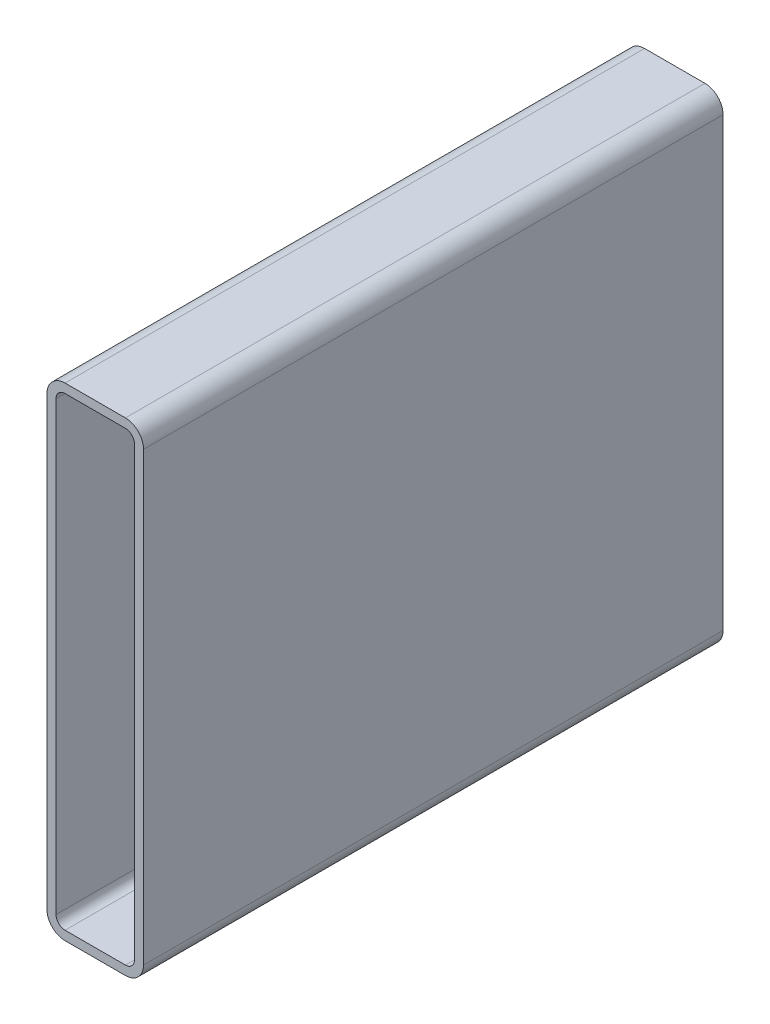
ISO-10303-21;
HEADER;
FILE_DESCRIPTION(('STEP AP214'),'2;1');
FILE_NAME('part.step','',(''),(''),'','','');
FILE_SCHEMA(('AUTOMOTIVE_DESIGN { 1 0 10303 214 1 1 1 1 }'));
ENDSEC;
DATA;
#1=APPLICATION_CONTEXT('core data for automotive mechanical design processes');
#2=APPLICATION_PROTOCOL_DEFINITION('international standard','automotive_design',2000,#1);
#3=PRODUCT_CONTEXT('',#1,'mechanical');
#4=PRODUCT('Part','Part','',(#3));
#5=PRODUCT_RELATED_PRODUCT_CATEGORY('part','',(#4));
#6=PRODUCT_DEFINITION_FORMATION('','',#4);
#7=PRODUCT_DEFINITION_CONTEXT('part definition',#1,'design');
#8=PRODUCT_DEFINITION('design','',#6,#7);
#9=PRODUCT_DEFINITION_SHAPE('','',#8);
#10=(LENGTH_UNIT() NAMED_UNIT(*) SI_UNIT(.MILLI.,.METRE.));
#11=(NAMED_UNIT(*) PLANE_ANGLE_UNIT() SI_UNIT($,.RADIAN.));
#12=(NAMED_UNIT(*) SI_UNIT($,.STERADIAN.) SOLID_ANGLE_UNIT());
#13=UNCERTAINTY_MEASURE_WITH_UNIT(LENGTH_MEASURE(1.E-05),#10,'distance_accuracy_value','');
#14=(GEOMETRIC_REPRESENTATION_CONTEXT(3) GLOBAL_UNCERTAINTY_ASSIGNED_CONTEXT((#13)) GLOBAL_UNIT_ASSIGNED_CONTEXT((#10,
#11,#12)) REPRESENTATION_CONTEXT('',''));
#15=CARTESIAN_POINT('',(0.,0.,0.));
#16=DIRECTION('',(0.,0.,1.));
#17=DIRECTION('',(1.,0.,0.));
#18=AXIS2_PLACEMENT_3D('',#15,#16,#17);
#19=CARTESIAN_POINT('',(9.52500000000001,244.475,304.8));
#20=DIRECTION('',(0.,0.,1.));
#21=DIRECTION('',(1.,0.,0.));
#22=AXIS2_PLACEMENT_3D('',#19,#20,#21);
#23=PLANE('',#22);
#24=CARTESIAN_POINT('',(9.52500000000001,244.475,304.8));
#25=DIRECTION('',(0.,0.,1.));
#26=DIRECTION('',(1.,0.,0.));
#27=AXIS2_PLACEMENT_3D('',#24,#25,#26);
#28=CIRCLE('',#27,9.52500000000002);
#29=CARTESIAN_POINT('',(9.525,254.,304.8));
#30=VERTEX_POINT('',#29);
#31=CARTESIAN_POINT('',(0.,244.475,304.8));
#32=VERTEX_POINT('',#31);
#33=EDGE_CURVE('E211',#30,#32,#28,.T.);
#34=ORIENTED_EDGE('',*,*,#33,.T.);
#35=DIRECTION('',(0.,-1.,0.));
#36=VECTOR('',#35,1.);
#37=CARTESIAN_POINT('',(0.,9.525,304.8));
#38=LINE('',#37,#36);
#39=CARTESIAN_POINT('',(0.,9.525,304.8));
#40=VERTEX_POINT('',#39);
#41=EDGE_CURVE('E214',#32,#40,#38,.T.);
#42=ORIENTED_EDGE('',*,*,#41,.T.);
#43=CARTESIAN_POINT('',(9.525,9.525,304.8));
#44=DIRECTION('',(0.,0.,1.));
#45=DIRECTION('',(1.,0.,0.));
#46=AXIS2_PLACEMENT_3D('',#43,#44,#45);
#47=CIRCLE('',#46,9.525);
#48=CARTESIAN_POINT('',(9.525,0.,304.8));
#49=VERTEX_POINT('',#48);
#50=EDGE_CURVE('E217',#40,#49,#47,.T.);
#51=ORIENTED_EDGE('',*,*,#50,.T.);
#52=DIRECTION('',(1.,0.,0.));
#53=VECTOR('',#52,1.);
#54=CARTESIAN_POINT('',(41.275,0.,304.8));
#55=LINE('',#54,#53);
#56=CARTESIAN_POINT('',(41.275,0.,304.8));
#57=VERTEX_POINT('',#56);
#58=EDGE_CURVE('E219',#49,#57,#55,.T.);
#59=ORIENTED_EDGE('',*,*,#58,.T.);
#60=CARTESIAN_POINT('',(41.275,9.525,304.8));
#61=DIRECTION('',(0.,0.,1.));
#62=DIRECTION('',(1.,0.,0.));
#63=AXIS2_PLACEMENT_3D('',#60,#61,#62);
#64=CIRCLE('',#63,9.525);
#65=CARTESIAN_POINT('',(50.8,9.525,304.8));
#66=VERTEX_POINT('',#65);
#67=EDGE_CURVE('E221',#57,#66,#64,.T.);
#68=ORIENTED_EDGE('',*,*,#67,.T.);
#69=DIRECTION('',(0.,1.,0.));
#70=VECTOR('',#69,1.);
#71=CARTESIAN_POINT('',(50.8,244.475,304.8));
#72=LINE('',#71,#70);
#73=CARTESIAN_POINT('',(50.8,244.475,304.8));
#74=VERTEX_POINT('',#73);
#75=EDGE_CURVE('E223',#66,#74,#72,.T.);
#76=ORIENTED_EDGE('',*,*,#75,.T.);
#77=CARTESIAN_POINT('',(41.275,244.475,304.8));
#78=DIRECTION('',(0.,0.,1.));
#79=DIRECTION('',(1.,0.,0.));
#80=AXIS2_PLACEMENT_3D('',#77,#78,#79);
#81=CIRCLE('',#80,9.52500000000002);
#82=CARTESIAN_POINT('',(41.275,254.,304.8));
#83=VERTEX_POINT('',#82);
#84=EDGE_CURVE('E225',#74,#83,#81,.T.);
#85=ORIENTED_EDGE('',*,*,#84,.T.);
#86=DIRECTION('',(-1.,0.,0.));
#87=VECTOR('',#86,1.);
#88=CARTESIAN_POINT('',(9.525,254.,304.8));
#89=LINE('',#88,#87);
#90=EDGE_CURVE('E227',#83,#30,#89,.T.);
#91=ORIENTED_EDGE('',*,*,#90,.T.);
#92=EDGE_LOOP('',(#34,#42,#51,#59,#68,#76,#85,#91));
#93=FACE_BOUND('',#92,.T.);
#94=DIRECTION('',(0.,-1.,0.));
#95=VECTOR('',#94,1.);
#96=CARTESIAN_POINT('',(4.7625,9.525,304.8));
#97=LINE('',#96,#95);
#98=CARTESIAN_POINT('',(4.7625,244.475,304.8));
#99=VERTEX_POINT('',#98);
#100=CARTESIAN_POINT('',(4.7625,9.525,304.8));
#101=VERTEX_POINT('',#100);
#102=EDGE_CURVE('E154',#99,#101,#97,.T.);
#103=ORIENTED_EDGE('',*,*,#102,.F.);
#104=CARTESIAN_POINT('',(9.52500000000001,244.475,304.8));
#105=DIRECTION('',(0.,0.,1.));
#106=DIRECTION('',(1.,0.,0.));
#107=AXIS2_PLACEMENT_3D('',#104,#105,#106);
#108=CIRCLE('',#107,4.76250000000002);
#109=CARTESIAN_POINT('',(9.525,249.2375,304.8));
#110=VERTEX_POINT('',#109);
#111=EDGE_CURVE('E146',#110,#99,#108,.T.);
#112=ORIENTED_EDGE('',*,*,#111,.F.);
#113=DIRECTION('',(-1.,0.,0.));
#114=VECTOR('',#113,1.);
#115=CARTESIAN_POINT('',(9.525,249.2375,304.8));
#116=LINE('',#115,#114);
#117=CARTESIAN_POINT('',(41.275,249.2375,304.8));
#118=VERTEX_POINT('',#117);
#119=EDGE_CURVE('E179',#118,#110,#116,.T.);
#120=ORIENTED_EDGE('',*,*,#119,.F.);
#121=CARTESIAN_POINT('',(41.275,244.475,304.8));
#122=DIRECTION('',(0.,0.,1.));
#123=DIRECTION('',(1.,0.,0.));
#124=AXIS2_PLACEMENT_3D('',#121,#122,#123);
#125=CIRCLE('',#124,4.76250000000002);
#126=CARTESIAN_POINT('',(46.0375,244.475,304.8));
#127=VERTEX_POINT('',#126);
#128=EDGE_CURVE('E177',#127,#118,#125,.T.);
#129=ORIENTED_EDGE('',*,*,#128,.F.);
#130=DIRECTION('',(0.,1.,0.));
#131=VECTOR('',#130,1.);
#132=CARTESIAN_POINT('',(46.0375,244.475,304.8));
#133=LINE('',#132,#131);
#134=CARTESIAN_POINT('',(46.0375,9.525,304.8));
#135=VERTEX_POINT('',#134);
#136=EDGE_CURVE('E175',#135,#127,#133,.T.);
#137=ORIENTED_EDGE('',*,*,#136,.F.);
#138=CARTESIAN_POINT('',(41.275,9.525,304.8));
#139=DIRECTION('',(0.,0.,1.));
#140=DIRECTION('',(1.,0.,0.));
#141=AXIS2_PLACEMENT_3D('',#138,#139,#140);
#142=CIRCLE('',#141,4.7625);
#143=CARTESIAN_POINT('',(41.275,4.7625,304.8));
#144=VERTEX_POINT('',#143);
#145=EDGE_CURVE('E173',#144,#135,#142,.T.);
#146=ORIENTED_EDGE('',*,*,#145,.F.);
#147=DIRECTION('',(1.,0.,0.));
#148=VECTOR('',#147,1.);
#149=CARTESIAN_POINT('',(41.275,4.7625,304.8));
#150=LINE('',#149,#148);
#151=CARTESIAN_POINT('',(9.525,4.7625,304.8));
#152=VERTEX_POINT('',#151);
#153=EDGE_CURVE('E169',#152,#144,#150,.T.);
#154=ORIENTED_EDGE('',*,*,#153,.F.);
#155=CARTESIAN_POINT('',(9.525,9.525,304.8));
#156=DIRECTION('',(0.,0.,1.));
#157=DIRECTION('',(1.,0.,0.));
#158=AXIS2_PLACEMENT_3D('',#155,#156,#157);
#159=CIRCLE('',#158,4.7625);
#160=EDGE_CURVE('E167',#101,#152,#159,.T.);
#161=ORIENTED_EDGE('',*,*,#160,.F.);
#162=EDGE_LOOP('',(#103,#112,#120,#129,#137,#146,#154,#161));
#163=FACE_BOUND('',#162,.T.);
#164=ADVANCED_FACE('F33',(#93,#163),#23,.T.);
#165=CARTESIAN_POINT('',(9.52500000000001,244.475,0.));
#166=DIRECTION('',(0.,0.,1.));
#167=DIRECTION('',(1.,0.,0.));
#168=AXIS2_PLACEMENT_3D('',#165,#166,#167);
#169=PLANE('',#168);
#170=CARTESIAN_POINT('',(9.52500000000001,244.475,0.));
#171=DIRECTION('',(0.,0.,1.));
#172=DIRECTION('',(1.,0.,0.));
#173=AXIS2_PLACEMENT_3D('',#170,#171,#172);
#174=CIRCLE('',#173,9.52500000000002);
#175=CARTESIAN_POINT('',(9.525,254.,0.));
#176=VERTEX_POINT('',#175);
#177=CARTESIAN_POINT('',(0.,244.475,0.));
#178=VERTEX_POINT('',#177);
#179=EDGE_CURVE('E162',#176,#178,#174,.T.);
#180=ORIENTED_EDGE('',*,*,#179,.F.);
#181=DIRECTION('',(-1.,0.,0.));
#182=VECTOR('',#181,1.);
#183=CARTESIAN_POINT('',(9.525,254.,0.));
#184=LINE('',#183,#182);
#185=CARTESIAN_POINT('',(41.275,254.,0.));
#186=VERTEX_POINT('',#185);
#187=EDGE_CURVE('E215',#186,#176,#184,.T.);
#188=ORIENTED_EDGE('',*,*,#187,.F.);
#189=CARTESIAN_POINT('',(41.275,244.475,0.));
#190=DIRECTION('',(0.,0.,1.));
#191=DIRECTION('',(1.,0.,0.));
#192=AXIS2_PLACEMENT_3D('',#189,#190,#191);
#193=CIRCLE('',#192,9.52500000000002);
#194=CARTESIAN_POINT('',(50.8,244.475,0.));
#195=VERTEX_POINT('',#194);
#196=EDGE_CURVE('E242',#195,#186,#193,.T.);
#197=ORIENTED_EDGE('',*,*,#196,.F.);
#198=DIRECTION('',(0.,1.,0.));
#199=VECTOR('',#198,1.);
#200=CARTESIAN_POINT('',(50.8,244.475,0.));
#201=LINE('',#200,#199);
#202=CARTESIAN_POINT('',(50.8,9.525,0.));
#203=VERTEX_POINT('',#202);
#204=EDGE_CURVE('E240',#203,#195,#201,.T.);
#205=ORIENTED_EDGE('',*,*,#204,.F.);
#206=CARTESIAN_POINT('',(41.275,9.525,0.));
#207=DIRECTION('',(0.,0.,1.));
#208=DIRECTION('',(1.,0.,0.));
#209=AXIS2_PLACEMENT_3D('',#206,#207,#208);
#210=CIRCLE('',#209,9.525);
#211=CARTESIAN_POINT('',(41.275,0.,0.));
#212=VERTEX_POINT('',#211);
#213=EDGE_CURVE('E238',#212,#203,#210,.T.);
#214=ORIENTED_EDGE('',*,*,#213,.F.);
#215=DIRECTION('',(1.,0.,0.));
#216=VECTOR('',#215,1.);
#217=CARTESIAN_POINT('',(41.275,0.,0.));
#218=LINE('',#217,#216);
#219=CARTESIAN_POINT('',(9.525,0.,0.));
#220=VERTEX_POINT('',#219);
#221=EDGE_CURVE('E236',#220,#212,#218,.T.);
#222=ORIENTED_EDGE('',*,*,#221,.F.);
#223=CARTESIAN_POINT('',(9.525,9.525,0.));
#224=DIRECTION('',(0.,0.,1.));
#225=DIRECTION('',(1.,0.,0.));
#226=AXIS2_PLACEMENT_3D('',#223,#224,#225);
#227=CIRCLE('',#226,9.525);
#228=CARTESIAN_POINT('',(0.,9.525,0.));
#229=VERTEX_POINT('',#228);
#230=EDGE_CURVE('E234',#229,#220,#227,.T.);
#231=ORIENTED_EDGE('',*,*,#230,.F.);
#232=DIRECTION('',(0.,-1.,0.));
#233=VECTOR('',#232,1.);
#234=CARTESIAN_POINT('',(0.,9.525,0.));
#235=LINE('',#234,#233);
#236=EDGE_CURVE('E232',#178,#229,#235,.T.);
#237=ORIENTED_EDGE('',*,*,#236,.F.);
#238=EDGE_LOOP('',(#180,#188,#197,#205,#214,#222,#231,#237));
#239=FACE_BOUND('',#238,.T.);
#240=CARTESIAN_POINT('',(9.52500000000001,244.475,0.));
#241=DIRECTION('',(0.,0.,1.));
#242=DIRECTION('',(1.,0.,0.));
#243=AXIS2_PLACEMENT_3D('',#240,#241,#242);
#244=CIRCLE('',#243,4.76250000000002);
#245=CARTESIAN_POINT('',(9.525,249.2375,0.));
#246=VERTEX_POINT('',#245);
#247=CARTESIAN_POINT('',(4.7625,244.475,0.));
#248=VERTEX_POINT('',#247);
#249=EDGE_CURVE('E56',#246,#248,#244,.T.);
#250=ORIENTED_EDGE('',*,*,#249,.T.);
#251=DIRECTION('',(0.,-1.,0.));
#252=VECTOR('',#251,1.);
#253=CARTESIAN_POINT('',(4.7625,9.525,0.));
#254=LINE('',#253,#252);
#255=CARTESIAN_POINT('',(4.7625,9.525,0.));
#256=VERTEX_POINT('',#255);
#257=EDGE_CURVE('E161',#248,#256,#254,.T.);
#258=ORIENTED_EDGE('',*,*,#257,.T.);
#259=CARTESIAN_POINT('',(9.525,9.525,0.));
#260=DIRECTION('',(0.,0.,1.));
#261=DIRECTION('',(1.,0.,0.));
#262=AXIS2_PLACEMENT_3D('',#259,#260,#261);
#263=CIRCLE('',#262,4.7625);
#264=CARTESIAN_POINT('',(9.525,4.7625,0.));
#265=VERTEX_POINT('',#264);
#266=EDGE_CURVE('E183',#256,#265,#263,.T.);
#267=ORIENTED_EDGE('',*,*,#266,.T.);
#268=DIRECTION('',(1.,0.,0.));
#269=VECTOR('',#268,1.);
#270=CARTESIAN_POINT('',(41.275,4.7625,0.));
#271=LINE('',#270,#269);
#272=CARTESIAN_POINT('',(41.275,4.7625,0.));
#273=VERTEX_POINT('',#272);
#274=EDGE_CURVE('E186',#265,#273,#271,.T.);
#275=ORIENTED_EDGE('',*,*,#274,.T.);
#276=CARTESIAN_POINT('',(41.275,9.525,0.));
#277=DIRECTION('',(0.,0.,1.));
#278=DIRECTION('',(1.,0.,0.));
#279=AXIS2_PLACEMENT_3D('',#276,#277,#278);
#280=CIRCLE('',#279,4.7625);
#281=CARTESIAN_POINT('',(46.0375,9.525,0.));
#282=VERTEX_POINT('',#281);
#283=EDGE_CURVE('E189',#273,#282,#280,.T.);
#284=ORIENTED_EDGE('',*,*,#283,.T.);
#285=DIRECTION('',(0.,1.,0.));
#286=VECTOR('',#285,1.);
#287=CARTESIAN_POINT('',(46.0375,244.475,0.));
#288=LINE('',#287,#286);
#289=CARTESIAN_POINT('',(46.0375,244.475,0.));
#290=VERTEX_POINT('',#289);
#291=EDGE_CURVE('E192',#282,#290,#288,.T.);
#292=ORIENTED_EDGE('',*,*,#291,.T.);
#293=CARTESIAN_POINT('',(41.275,244.475,0.));
#294=DIRECTION('',(0.,0.,1.));
#295=DIRECTION('',(1.,0.,0.));
#296=AXIS2_PLACEMENT_3D('',#293,#294,#295);
#297=CIRCLE('',#296,4.76250000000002);
#298=CARTESIAN_POINT('',(41.275,249.2375,0.));
#299=VERTEX_POINT('',#298);
#300=EDGE_CURVE('E195',#290,#299,#297,.T.);
#301=ORIENTED_EDGE('',*,*,#300,.T.);
#302=DIRECTION('',(-1.,0.,0.));
#303=VECTOR('',#302,1.);
#304=CARTESIAN_POINT('',(9.525,249.2375,0.));
#305=LINE('',#304,#303);
#306=EDGE_CURVE('E155',#299,#246,#305,.T.);
#307=ORIENTED_EDGE('',*,*,#306,.T.);
#308=EDGE_LOOP('',(#250,#258,#267,#275,#284,#292,#301,#307));
#309=FACE_BOUND('',#308,.T.);
#310=ADVANCED_FACE('F272',(#239,#309),#169,.F.);
#311=CARTESIAN_POINT('',(9.52500000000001,244.475,304.8));
#312=DIRECTION('',(0.,0.,-1.));
#313=DIRECTION('',(-1.,0.,0.));
#314=AXIS2_PLACEMENT_3D('',#311,#312,#313);
#315=CYLINDRICAL_SURFACE('',#314,9.52500000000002);
#316=ORIENTED_EDGE('',*,*,#179,.T.);
#317=DIRECTION('',(0.,0.,-1.));
#318=VECTOR('',#317,1.);
#319=CARTESIAN_POINT('',(0.,244.475,304.8));
#320=LINE('',#319,#318);
#321=EDGE_CURVE('E11',#32,#178,#320,.T.);
#322=ORIENTED_EDGE('',*,*,#321,.F.);
#323=ORIENTED_EDGE('',*,*,#33,.F.);
#324=DIRECTION('',(0.,0.,-1.));
#325=VECTOR('',#324,1.);
#326=CARTESIAN_POINT('',(9.525,254.,304.8));
#327=LINE('',#326,#325);
#328=EDGE_CURVE('E229',#30,#176,#327,.T.);
#329=ORIENTED_EDGE('',*,*,#328,.T.);
#330=EDGE_LOOP('',(#316,#322,#323,#329));
#331=FACE_BOUND('',#330,.T.);
#332=ADVANCED_FACE('F35',(#331),#315,.T.);
#333=CARTESIAN_POINT('',(0.,9.525,304.8));
#334=DIRECTION('',(1.,0.,0.));
#335=DIRECTION('',(0.,0.,-1.));
#336=AXIS2_PLACEMENT_3D('',#333,#334,#335);
#337=PLANE('',#336);
#338=ORIENTED_EDGE('',*,*,#236,.T.);
#339=DIRECTION('',(0.,0.,-1.));
#340=VECTOR('',#339,1.);
#341=CARTESIAN_POINT('',(0.,9.525,304.8));
#342=LINE('',#341,#340);
#343=EDGE_CURVE('E41',#40,#229,#342,.T.);
#344=ORIENTED_EDGE('',*,*,#343,.F.);
#345=ORIENTED_EDGE('',*,*,#41,.F.);
#346=ORIENTED_EDGE('',*,*,#321,.T.);
#347=EDGE_LOOP('',(#338,#344,#345,#346));
#348=FACE_BOUND('',#347,.T.);
#349=ADVANCED_FACE('F289',(#348),#337,.F.);
#350=CARTESIAN_POINT('',(9.525,9.525,304.8));
#351=DIRECTION('',(0.,0.,-1.));
#352=DIRECTION('',(-1.,0.,0.));
#353=AXIS2_PLACEMENT_3D('',#350,#351,#352);
#354=CYLINDRICAL_SURFACE('',#353,9.525);
#355=ORIENTED_EDGE('',*,*,#230,.T.);
#356=DIRECTION('',(0.,0.,-1.));
#357=VECTOR('',#356,1.);
#358=CARTESIAN_POINT('',(9.525,0.,304.8));
#359=LINE('',#358,#357);
#360=EDGE_CURVE('E259',#49,#220,#359,.T.);
#361=ORIENTED_EDGE('',*,*,#360,.F.);
#362=ORIENTED_EDGE('',*,*,#50,.F.);
#363=ORIENTED_EDGE('',*,*,#343,.T.);
#364=EDGE_LOOP('',(#355,#361,#362,#363));
#365=FACE_BOUND('',#364,.T.);
#366=ADVANCED_FACE('F266',(#365),#354,.T.);
#367=CARTESIAN_POINT('',(41.275,0.,304.8));
#368=DIRECTION('',(0.,1.,0.));
#369=DIRECTION('',(0.,0.,1.));
#370=AXIS2_PLACEMENT_3D('',#367,#368,#369);
#371=PLANE('',#370);
#372=ORIENTED_EDGE('',*,*,#221,.T.);
#373=DIRECTION('',(0.,0.,-1.));
#374=VECTOR('',#373,1.);
#375=CARTESIAN_POINT('',(41.275,0.,304.8));
#376=LINE('',#375,#374);
#377=EDGE_CURVE('E256',#57,#212,#376,.T.);
#378=ORIENTED_EDGE('',*,*,#377,.F.);
#379=ORIENTED_EDGE('',*,*,#58,.F.);
#380=ORIENTED_EDGE('',*,*,#360,.T.);
#381=EDGE_LOOP('',(#372,#378,#379,#380));
#382=FACE_BOUND('',#381,.T.);
#383=ADVANCED_FACE('F278',(#382),#371,.F.);
#384=CARTESIAN_POINT('',(41.275,9.525,304.8));
#385=DIRECTION('',(0.,0.,-1.));
#386=DIRECTION('',(-1.,0.,0.));
#387=AXIS2_PLACEMENT_3D('',#384,#385,#386);
#388=CYLINDRICAL_SURFACE('',#387,9.525);
#389=ORIENTED_EDGE('',*,*,#213,.T.);
#390=DIRECTION('',(0.,0.,-1.));
#391=VECTOR('',#390,1.);
#392=CARTESIAN_POINT('',(50.8,9.525,304.8));
#393=LINE('',#392,#391);
#394=EDGE_CURVE('E253',#66,#203,#393,.T.);
#395=ORIENTED_EDGE('',*,*,#394,.F.);
#396=ORIENTED_EDGE('',*,*,#67,.F.);
#397=ORIENTED_EDGE('',*,*,#377,.T.);
#398=EDGE_LOOP('',(#389,#395,#396,#397));
#399=FACE_BOUND('',#398,.T.);
#400=ADVANCED_FACE('F282',(#399),#388,.T.);
#401=CARTESIAN_POINT('',(50.8,244.475,304.8));
#402=DIRECTION('',(-1.,0.,0.));
#403=DIRECTION('',(0.,0.,1.));
#404=AXIS2_PLACEMENT_3D('',#401,#402,#403);
#405=PLANE('',#404);
#406=ORIENTED_EDGE('',*,*,#204,.T.);
#407=DIRECTION('',(0.,0.,-1.));
#408=VECTOR('',#407,1.);
#409=CARTESIAN_POINT('',(50.8,244.475,304.8));
#410=LINE('',#409,#408);
#411=EDGE_CURVE('E250',#74,#195,#410,.T.);
#412=ORIENTED_EDGE('',*,*,#411,.F.);
#413=ORIENTED_EDGE('',*,*,#75,.F.);
#414=ORIENTED_EDGE('',*,*,#394,.T.);
#415=EDGE_LOOP('',(#406,#412,#413,#414));
#416=FACE_BOUND('',#415,.T.);
#417=ADVANCED_FACE('F302',(#416),#405,.F.);
#418=CARTESIAN_POINT('',(41.275,244.475,304.8));
#419=DIRECTION('',(0.,0.,-1.));
#420=DIRECTION('',(-1.,0.,0.));
#421=AXIS2_PLACEMENT_3D('',#418,#419,#420);
#422=CYLINDRICAL_SURFACE('',#421,9.52500000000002);
#423=ORIENTED_EDGE('',*,*,#196,.T.);
#424=DIRECTION('',(0.,0.,-1.));
#425=VECTOR('',#424,1.);
#426=CARTESIAN_POINT('',(41.275,254.,304.8));
#427=LINE('',#426,#425);
#428=EDGE_CURVE('E247',#83,#186,#427,.T.);
#429=ORIENTED_EDGE('',*,*,#428,.F.);
#430=ORIENTED_EDGE('',*,*,#84,.F.);
#431=ORIENTED_EDGE('',*,*,#411,.T.);
#432=EDGE_LOOP('',(#423,#429,#430,#431));
#433=FACE_BOUND('',#432,.T.);
#434=ADVANCED_FACE('F300',(#433),#422,.T.);
#435=CARTESIAN_POINT('',(9.525,254.,304.8));
#436=DIRECTION('',(0.,-1.,0.));
#437=DIRECTION('',(0.,0.,-1.));
#438=AXIS2_PLACEMENT_3D('',#435,#436,#437);
#439=PLANE('',#438);
#440=ORIENTED_EDGE('',*,*,#187,.T.);
#441=ORIENTED_EDGE('',*,*,#328,.F.);
#442=ORIENTED_EDGE('',*,*,#90,.F.);
#443=ORIENTED_EDGE('',*,*,#428,.T.);
#444=EDGE_LOOP('',(#440,#441,#442,#443));
#445=FACE_BOUND('',#444,.T.);
#446=ADVANCED_FACE('F295',(#445),#439,.F.);
#447=CARTESIAN_POINT('',(9.52500000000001,244.475,304.8));
#448=DIRECTION('',(0.,0.,-1.));
#449=DIRECTION('',(-1.,0.,0.));
#450=AXIS2_PLACEMENT_3D('',#447,#448,#449);
#451=CYLINDRICAL_SURFACE('',#450,4.76250000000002);
#452=ORIENTED_EDGE('',*,*,#249,.F.);
#453=DIRECTION('',(0.,0.,-1.));
#454=VECTOR('',#453,1.);
#455=CARTESIAN_POINT('',(9.525,249.2375,304.8));
#456=LINE('',#455,#454);
#457=EDGE_CURVE('E150',#110,#246,#456,.T.);
#458=ORIENTED_EDGE('',*,*,#457,.F.);
#459=ORIENTED_EDGE('',*,*,#111,.T.);
#460=DIRECTION('',(0.,0.,-1.));
#461=VECTOR('',#460,1.);
#462=CARTESIAN_POINT('',(4.7625,244.475,304.8));
#463=LINE('',#462,#461);
#464=EDGE_CURVE('E149',#99,#248,#463,.T.);
#465=ORIENTED_EDGE('',*,*,#464,.T.);
#466=EDGE_LOOP('',(#452,#458,#459,#465));
#467=FACE_BOUND('',#466,.T.);
#468=ADVANCED_FACE('F148',(#467),#451,.F.);
#469=CARTESIAN_POINT('',(4.7625,9.525,304.8));
#470=DIRECTION('',(1.,0.,0.));
#471=DIRECTION('',(0.,0.,-1.));
#472=AXIS2_PLACEMENT_3D('',#469,#470,#471);
#473=PLANE('',#472);
#474=ORIENTED_EDGE('',*,*,#257,.F.);
#475=ORIENTED_EDGE('',*,*,#464,.F.);
#476=ORIENTED_EDGE('',*,*,#102,.T.);
#477=DIRECTION('',(0.,0.,-1.));
#478=VECTOR('',#477,1.);
#479=CARTESIAN_POINT('',(4.7625,9.525,304.8));
#480=LINE('',#479,#478);
#481=EDGE_CURVE('E163',#101,#256,#480,.T.);
#482=ORIENTED_EDGE('',*,*,#481,.T.);
#483=EDGE_LOOP('',(#474,#475,#476,#482));
#484=FACE_BOUND('',#483,.T.);
#485=ADVANCED_FACE('F158',(#484),#473,.T.);
#486=CARTESIAN_POINT('',(9.525,9.525,304.8));
#487=DIRECTION('',(0.,0.,-1.));
#488=DIRECTION('',(-1.,0.,0.));
#489=AXIS2_PLACEMENT_3D('',#486,#487,#488);
#490=CYLINDRICAL_SURFACE('',#489,4.7625);
#491=ORIENTED_EDGE('',*,*,#266,.F.);
#492=ORIENTED_EDGE('',*,*,#481,.F.);
#493=ORIENTED_EDGE('',*,*,#160,.T.);
#494=DIRECTION('',(0.,0.,-1.));
#495=VECTOR('',#494,1.);
#496=CARTESIAN_POINT('',(9.525,4.7625,304.8));
#497=LINE('',#496,#495);
#498=EDGE_CURVE('E208',#152,#265,#497,.T.);
#499=ORIENTED_EDGE('',*,*,#498,.T.);
#500=EDGE_LOOP('',(#491,#492,#493,#499));
#501=FACE_BOUND('',#500,.T.);
#502=ADVANCED_FACE('F327',(#501),#490,.F.);
#503=CARTESIAN_POINT('',(41.275,4.7625,304.8));
#504=DIRECTION('',(0.,1.,0.));
#505=DIRECTION('',(0.,0.,1.));
#506=AXIS2_PLACEMENT_3D('',#503,#504,#505);
#507=PLANE('',#506);
#508=ORIENTED_EDGE('',*,*,#274,.F.);
#509=ORIENTED_EDGE('',*,*,#498,.F.);
#510=ORIENTED_EDGE('',*,*,#153,.T.);
#511=DIRECTION('',(0.,0.,-1.));
#512=VECTOR('',#511,1.);
#513=CARTESIAN_POINT('',(41.275,4.7625,304.8));
#514=LINE('',#513,#512);
#515=EDGE_CURVE('E206',#144,#273,#514,.T.);
#516=ORIENTED_EDGE('',*,*,#515,.T.);
#517=EDGE_LOOP('',(#508,#509,#510,#516));
#518=FACE_BOUND('',#517,.T.);
#519=ADVANCED_FACE('F331',(#518),#507,.T.);
#520=CARTESIAN_POINT('',(41.275,9.525,304.8));
#521=DIRECTION('',(0.,0.,-1.));
#522=DIRECTION('',(-1.,0.,0.));
#523=AXIS2_PLACEMENT_3D('',#520,#521,#522);
#524=CYLINDRICAL_SURFACE('',#523,4.7625);
#525=ORIENTED_EDGE('',*,*,#283,.F.);
#526=ORIENTED_EDGE('',*,*,#515,.F.);
#527=ORIENTED_EDGE('',*,*,#145,.T.);
#528=DIRECTION('',(0.,0.,-1.));
#529=VECTOR('',#528,1.);
#530=CARTESIAN_POINT('',(46.0375,9.525,304.8));
#531=LINE('',#530,#529);
#532=EDGE_CURVE('E204',#135,#282,#531,.T.);
#533=ORIENTED_EDGE('',*,*,#532,.T.);
#534=EDGE_LOOP('',(#525,#526,#527,#533));
#535=FACE_BOUND('',#534,.T.);
#536=ADVANCED_FACE('F337',(#535),#524,.F.);
#537=CARTESIAN_POINT('',(46.0375,244.475,304.8));
#538=DIRECTION('',(-1.,0.,0.));
#539=DIRECTION('',(0.,0.,1.));
#540=AXIS2_PLACEMENT_3D('',#537,#538,#539);
#541=PLANE('',#540);
#542=ORIENTED_EDGE('',*,*,#291,.F.);
#543=ORIENTED_EDGE('',*,*,#532,.F.);
#544=ORIENTED_EDGE('',*,*,#136,.T.);
#545=DIRECTION('',(0.,0.,-1.));
#546=VECTOR('',#545,1.);
#547=CARTESIAN_POINT('',(46.0375,244.475,304.8));
#548=LINE('',#547,#546);
#549=EDGE_CURVE('E202',#127,#290,#548,.T.);
#550=ORIENTED_EDGE('',*,*,#549,.T.);
#551=EDGE_LOOP('',(#542,#543,#544,#550));
#552=FACE_BOUND('',#551,.T.);
#553=ADVANCED_FACE('F341',(#552),#541,.T.);
#554=CARTESIAN_POINT('',(41.275,244.475,304.8));
#555=DIRECTION('',(0.,0.,-1.));
#556=DIRECTION('',(-1.,0.,0.));
#557=AXIS2_PLACEMENT_3D('',#554,#555,#556);
#558=CYLINDRICAL_SURFACE('',#557,4.76250000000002);
#559=ORIENTED_EDGE('',*,*,#300,.F.);
#560=ORIENTED_EDGE('',*,*,#549,.F.);
#561=ORIENTED_EDGE('',*,*,#128,.T.);
#562=DIRECTION('',(0.,0.,-1.));
#563=VECTOR('',#562,1.);
#564=CARTESIAN_POINT('',(41.275,249.2375,304.8));
#565=LINE('',#564,#563);
#566=EDGE_CURVE('E48',#118,#299,#565,.T.);
#567=ORIENTED_EDGE('',*,*,#566,.T.);
#568=EDGE_LOOP('',(#559,#560,#561,#567));
#569=FACE_BOUND('',#568,.T.);
#570=ADVANCED_FACE('F345',(#569),#558,.F.);
#571=CARTESIAN_POINT('',(9.525,249.2375,304.8));
#572=DIRECTION('',(0.,-1.,0.));
#573=DIRECTION('',(0.,0.,-1.));
#574=AXIS2_PLACEMENT_3D('',#571,#572,#573);
#575=PLANE('',#574);
#576=ORIENTED_EDGE('',*,*,#306,.F.);
#577=ORIENTED_EDGE('',*,*,#566,.F.);
#578=ORIENTED_EDGE('',*,*,#119,.T.);
#579=ORIENTED_EDGE('',*,*,#457,.T.);
#580=EDGE_LOOP('',(#576,#577,#578,#579));
#581=FACE_BOUND('',#580,.T.);
#582=ADVANCED_FACE('F349',(#581),#575,.T.);
#583=CLOSED_SHELL('',(#164,#310,#332,#349,#366,#383,#400,#417,#434,#446,#468,#485,#502,#519,
#536,#553,#570,#582));
#584=MANIFOLD_SOLID_BREP('B2',#583);
#585=ADVANCED_BREP_SHAPE_REPRESENTATION('',(#18,#584),#14);
#586=SHAPE_DEFINITION_REPRESENTATION(#9,#585);
ENDSEC;
END-ISO-10303-21;
